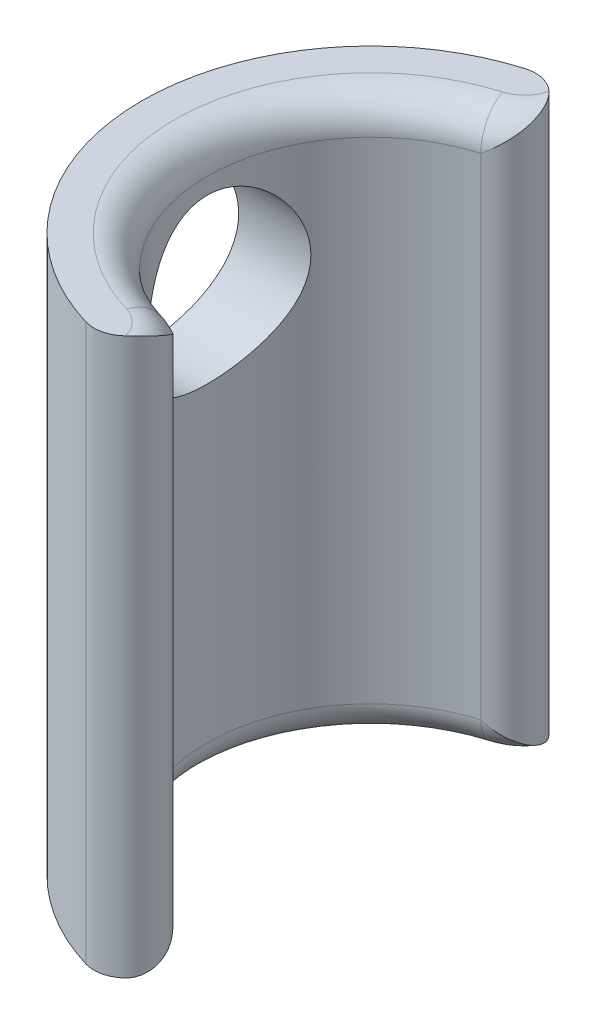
ISO-10303-21;
HEADER;
FILE_DESCRIPTION(('STEP AP214'),'2;1');
FILE_NAME('part.step','',(''),(''),'','','');
FILE_SCHEMA(('AUTOMOTIVE_DESIGN { 1 0 10303 214 1 1 1 1 }'));
ENDSEC;
DATA;
#1=APPLICATION_CONTEXT('core data for automotive mechanical design processes');
#2=APPLICATION_PROTOCOL_DEFINITION('international standard','automotive_design',2000,#1);
#3=PRODUCT_CONTEXT('',#1,'mechanical');
#4=PRODUCT('Part','Part','',(#3));
#5=PRODUCT_RELATED_PRODUCT_CATEGORY('part','',(#4));
#6=PRODUCT_DEFINITION_FORMATION('','',#4);
#7=PRODUCT_DEFINITION_CONTEXT('part definition',#1,'design');
#8=PRODUCT_DEFINITION('design','',#6,#7);
#9=PRODUCT_DEFINITION_SHAPE('','',#8);
#10=(LENGTH_UNIT() NAMED_UNIT(*) SI_UNIT(.MILLI.,.METRE.));
#11=(NAMED_UNIT(*) PLANE_ANGLE_UNIT() SI_UNIT($,.RADIAN.));
#12=(NAMED_UNIT(*) SI_UNIT($,.STERADIAN.) SOLID_ANGLE_UNIT());
#13=UNCERTAINTY_MEASURE_WITH_UNIT(LENGTH_MEASURE(1.E-05),#10,'distance_accuracy_value','');
#14=(GEOMETRIC_REPRESENTATION_CONTEXT(3) GLOBAL_UNCERTAINTY_ASSIGNED_CONTEXT((#13)) GLOBAL_UNIT_ASSIGNED_CONTEXT((#10,
#11,#12)) REPRESENTATION_CONTEXT('',''));
#15=CARTESIAN_POINT('',(0.,0.,0.));
#16=DIRECTION('',(0.,0.,1.));
#17=DIRECTION('',(1.,0.,0.));
#18=AXIS2_PLACEMENT_3D('',#15,#16,#17);
#19=CARTESIAN_POINT('',(0.,17.,0.));
#20=DIRECTION('',(0.,-1.,0.));
#21=DIRECTION('',(0.,0.,-1.));
#22=AXIS2_PLACEMENT_3D('',#19,#20,#21);
#23=CYLINDRICAL_SURFACE('',#22,5.);
#24=CARTESIAN_POINT('',(-4.33012701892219,13.,-2.5));
#25=CARTESIAN_POINT('',(-4.33013982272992,12.8697334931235,-2.49998948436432));
#26=CARTESIAN_POINT('',(-4.33609541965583,12.7392972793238,-2.48974954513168));
#27=CARTESIAN_POINT('',(-4.35905877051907,12.4824310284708,-2.44930840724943));
#28=CARTESIAN_POINT('',(-4.37608974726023,12.3560099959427,-2.41906526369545));
#29=CARTESIAN_POINT('',(-4.41873376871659,12.1113710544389,-2.3402497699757));
#30=CARTESIAN_POINT('',(-4.44430111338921,11.9931134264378,-2.29177485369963));
#31=CARTESIAN_POINT('',(-4.50106659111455,11.7664394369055,-2.17816884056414));
#32=CARTESIAN_POINT('',(-4.53226502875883,11.6580236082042,-2.11303684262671));
#33=CARTESIAN_POINT('',(-4.59992173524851,11.4442356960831,-1.96166634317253));
#34=CARTESIAN_POINT('',(-4.63660159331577,11.3398521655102,-1.87413008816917));
#35=CARTESIAN_POINT('',(-4.70929956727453,11.1464790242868,-1.68313452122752));
#36=CARTESIAN_POINT('',(-4.74531734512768,11.0574970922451,-1.57966731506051));
#37=CARTESIAN_POINT('',(-4.81553692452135,10.8915821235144,-1.35122390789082));
#38=CARTESIAN_POINT('',(-4.84945266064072,10.8158655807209,-1.22526797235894));
#39=CARTESIAN_POINT('',(-4.90876890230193,10.6871478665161,-0.960392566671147));
#40=CARTESIAN_POINT('',(-4.93417477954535,10.6341323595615,-0.821481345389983));
#41=CARTESIAN_POINT('',(-4.9720115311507,10.556238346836,-0.545112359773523));
#42=CARTESIAN_POINT('',(-4.98523700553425,10.5296261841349,-0.408254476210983));
#43=CARTESIAN_POINT('',(-5.00018959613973,10.4995847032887,-0.131426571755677));
#44=CARTESIAN_POINT('',(-5.00192366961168,10.4961413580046,0.00854151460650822));
#45=CARTESIAN_POINT('',(-4.99407454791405,10.5118666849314,0.274581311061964));
#46=CARTESIAN_POINT('',(-4.98546239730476,10.5290950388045,0.400802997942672));
#47=CARTESIAN_POINT('',(-4.95935613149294,10.5822021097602,0.64828442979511));
#48=CARTESIAN_POINT('',(-4.94186135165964,10.6180822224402,0.769543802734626));
#49=CARTESIAN_POINT('',(-4.89928958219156,10.7077064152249,1.00577347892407));
#50=CARTESIAN_POINT('',(-4.87411103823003,10.7616907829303,1.120633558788));
#51=CARTESIAN_POINT('',(-4.81844114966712,10.8856585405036,1.33994200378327));
#52=CARTESIAN_POINT('',(-4.78794790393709,10.9556476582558,1.4443866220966));
#53=CARTESIAN_POINT('',(-4.72110985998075,11.1172383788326,1.6504341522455));
#54=CARTESIAN_POINT('',(-4.68448439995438,11.210257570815,1.75083518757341));
#55=CARTESIAN_POINT('',(-4.61135851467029,11.4114743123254,1.93526092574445));
#56=CARTESIAN_POINT('',(-4.57485820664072,11.5196834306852,2.01927302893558));
#57=CARTESIAN_POINT('',(-4.50360390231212,11.7566204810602,2.17376333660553));
#58=CARTESIAN_POINT('',(-4.46910799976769,11.8862150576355,2.24304328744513));
#59=CARTESIAN_POINT('',(-4.4093862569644,12.1573441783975,2.35829778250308));
#60=CARTESIAN_POINT('',(-4.38415075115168,12.2988660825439,2.40429664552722));
#61=CARTESIAN_POINT('',(-4.34861589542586,12.578036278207,2.4679505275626));
#62=CARTESIAN_POINT('',(-4.33729139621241,12.7151027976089,2.48756280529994));
#63=CARTESIAN_POINT('',(-4.32794798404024,12.9910033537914,2.50379236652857));
#64=CARTESIAN_POINT('',(-4.32991967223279,13.1298360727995,2.50042589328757));
#65=CARTESIAN_POINT('',(-4.34585841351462,13.3891347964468,2.47259010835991));
#66=CARTESIAN_POINT('',(-4.35848968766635,13.5099486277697,2.45046954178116));
#67=CARTESIAN_POINT('',(-4.39235053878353,13.7459194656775,2.38924071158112));
#68=CARTESIAN_POINT('',(-4.41358290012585,13.8610746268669,2.35012694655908));
#69=CARTESIAN_POINT('',(-4.46340555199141,14.0885283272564,2.25411897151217));
#70=CARTESIAN_POINT('',(-4.49229108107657,14.2004475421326,2.19648515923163));
#71=CARTESIAN_POINT('',(-4.55390298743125,14.4136731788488,2.0657176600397));
#72=CARTESIAN_POINT('',(-4.58663133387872,14.5149741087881,1.99257601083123));
#73=CARTESIAN_POINT('',(-4.65719996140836,14.7174469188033,1.82209291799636));
#74=CARTESIAN_POINT('',(-4.69516457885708,14.8169928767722,1.72286318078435));
#75=CARTESIAN_POINT('',(-4.76835587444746,14.9985305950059,1.5085112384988));
#76=CARTESIAN_POINT('',(-4.80358162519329,15.0805164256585,1.39338368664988));
#77=CARTESIAN_POINT('',(-4.86853404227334,15.2264343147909,1.14633840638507));
#78=CARTESIAN_POINT('',(-4.89809104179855,15.2898327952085,1.01405774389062));
#79=CARTESIAN_POINT('',(-4.9470838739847,15.392844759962,0.738805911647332));
#80=CARTESIAN_POINT('',(-4.96652859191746,15.4324791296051,0.595844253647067));
#81=CARTESIAN_POINT('',(-4.99168770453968,15.4834214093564,0.317449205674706));
#82=CARTESIAN_POINT('',(-4.99849819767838,15.4969946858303,0.182528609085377));
#83=CARTESIAN_POINT('',(-5.00105325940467,15.5021081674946,-0.0878149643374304));
#84=CARTESIAN_POINT('',(-4.99680170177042,15.4936560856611,-0.223237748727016));
#85=CARTESIAN_POINT('',(-4.97834922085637,15.4564589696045,-0.481344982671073));
#86=CARTESIAN_POINT('',(-4.96482236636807,15.4290878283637,-0.604280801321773));
#87=CARTESIAN_POINT('',(-4.92980234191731,15.3566825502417,-0.843614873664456));
#88=CARTESIAN_POINT('',(-4.90830802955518,15.3116458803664,-0.960012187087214));
#89=CARTESIAN_POINT('',(-4.85814826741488,15.2031821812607,-1.18855854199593));
#90=CARTESIAN_POINT('',(-4.82921542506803,15.1390509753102,-1.30031295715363));
#91=CARTESIAN_POINT('',(-4.76720333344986,14.9951058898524,-1.51193650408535));
#92=CARTESIAN_POINT('',(-4.73412218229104,14.9152848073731,-1.61180014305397));
#93=CARTESIAN_POINT('',(-4.66321523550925,14.7330042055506,-1.8072854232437));
#94=CARTESIAN_POINT('',(-4.62524489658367,14.6290822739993,-1.90149582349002));
#95=CARTESIAN_POINT('',(-4.55157698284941,14.4063847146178,-2.07165660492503));
#96=CARTESIAN_POINT('',(-4.51588143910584,14.2875960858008,-2.1475908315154));
#97=CARTESIAN_POINT('',(-4.44998982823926,14.0333638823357,-2.28108393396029));
#98=CARTESIAN_POINT('',(-4.42000320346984,13.8975126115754,-2.3379862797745));
#99=CARTESIAN_POINT('',(-4.38370272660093,13.6867773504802,-2.40494911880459));
#100=CARTESIAN_POINT('',(-4.37305486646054,13.6154402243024,-2.42419582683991));
#101=CARTESIAN_POINT('',(-4.35507574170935,13.4709593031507,-2.45635087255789));
#102=CARTESIAN_POINT('',(-4.34774215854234,13.3978168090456,-2.46926364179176));
#103=CARTESIAN_POINT('',(-4.3382377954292,13.2704990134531,-2.48591166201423));
#104=CARTESIAN_POINT('',(-4.33520487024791,13.2165836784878,-2.49118864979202));
#105=CARTESIAN_POINT('',(-4.33114674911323,13.1084553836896,-2.49823512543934));
#106=CARTESIAN_POINT('',(-4.33012168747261,13.0542424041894,-2.50000437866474));
#107=CARTESIAN_POINT('',(-4.33012701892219,13.,-2.5));
#108=B_SPLINE_CURVE_WITH_KNOTS('',3,(#24,#25,#26,#27,#28,#29,#30,#31,#32,#33,#34,#35,#36,#37,
#38,#39,#40,#41,#42,#43,#44,#45,#46,#47,#48,#49,#50,#51,#52,#53,#54,#55,#56,#57,#58,#59,#60,#61,
#62,#63,#64,#65,#66,#67,#68,#69,#70,#71,#72,#73,#74,#75,#76,#77,#78,#79,#80,#81,#82,#83,#84,#85,
#86,#87,#88,#89,#90,#91,#92,#93,#94,#95,#96,#97,#98,#99,#100,#101,#102,#103,#104,#105,#106,
#107),.UNSPECIFIED.,.T.,.F.,(4,2,2,2,2,2,2,2,2,2,2,2,2,2,2,2,2,2,2,2,2,2,2,2,2,2,2,2,2,2,2,2,2,
2,2,2,2,2,2,2,2,4),(0.,0.39058030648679,0.781982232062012,1.17132148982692,1.56068181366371,
1.98215578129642,2.40383927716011,2.85394730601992,3.30377067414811,3.72158712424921,
4.13915059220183,4.52040243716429,4.90168281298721,5.2882383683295,5.67493248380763,
6.0981797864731,6.5217512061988,6.97222104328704,7.42221935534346,7.83655727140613,
8.25060232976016,8.61935458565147,8.98822631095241,9.37418241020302,9.76033715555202,
10.1951685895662,10.6301466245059,11.076604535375,11.5226694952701,11.927806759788,
12.3328021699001,12.7111106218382,13.0894733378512,13.4840187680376,13.8787457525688,
14.3127560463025,14.7471485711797,15.195268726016,15.4189244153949,15.6424233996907,
15.8050484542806,15.9676843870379),.UNSPECIFIED.);
#109=CARTESIAN_POINT('',(-4.33012701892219,13.,-2.5));
#110=VERTEX_POINT('',#109);
#111=EDGE_CURVE('E147',#110,#110,#108,.T.);
#112=ORIENTED_EDGE('',*,*,#111,.T.);
#113=EDGE_LOOP('',(#112));
#114=FACE_BOUND('',#113,.T.);
#115=DIRECTION('',(0.,-1.,0.));
#116=VECTOR('',#115,1.);
#117=CARTESIAN_POINT('',(-1.42857142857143,17.,-4.79157423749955));
#118=LINE('',#117,#116);
#119=CARTESIAN_POINT('',(-1.42857142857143,16.,-4.79157423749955));
#120=VERTEX_POINT('',#119);
#121=CARTESIAN_POINT('',(-1.42857142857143,1.,-4.79157423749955));
#122=VERTEX_POINT('',#121);
#123=EDGE_CURVE('E125',#120,#122,#118,.T.);
#124=ORIENTED_EDGE('',*,*,#123,.F.);
#125=CARTESIAN_POINT('',(0.,16.,0.));
#126=DIRECTION('',(0.,-1.,0.));
#127=DIRECTION('',(0.,0.,-1.));
#128=AXIS2_PLACEMENT_3D('',#125,#126,#127);
#129=CIRCLE('',#128,5.);
#130=CARTESIAN_POINT('',(-1.42857142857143,16.,4.79157423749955));
#131=VERTEX_POINT('',#130);
#132=EDGE_CURVE('E213',#120,#131,#129,.F.);
#133=ORIENTED_EDGE('',*,*,#132,.T.);
#134=DIRECTION('',(0.,-1.,0.));
#135=VECTOR('',#134,1.);
#136=CARTESIAN_POINT('',(-1.42857142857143,17.,4.79157423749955));
#137=LINE('',#136,#135);
#138=CARTESIAN_POINT('',(-1.42857142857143,1.,4.79157423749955));
#139=VERTEX_POINT('',#138);
#140=EDGE_CURVE('E117',#131,#139,#137,.T.);
#141=ORIENTED_EDGE('',*,*,#140,.T.);
#142=CARTESIAN_POINT('',(0.,1.,0.));
#143=DIRECTION('',(0.,-1.,0.));
#144=DIRECTION('',(0.,0.,-1.));
#145=AXIS2_PLACEMENT_3D('',#142,#143,#144);
#146=CIRCLE('',#145,5.);
#147=EDGE_CURVE('E206',#139,#122,#146,.T.);
#148=ORIENTED_EDGE('',*,*,#147,.T.);
#149=EDGE_LOOP('',(#124,#133,#141,#148));
#150=FACE_BOUND('',#149,.T.);
#151=ADVANCED_FACE('F37',(#114,#150),#23,.F.);
#152=CARTESIAN_POINT('',(0.,17.,0.));
#153=DIRECTION('',(0.,-1.,0.));
#154=DIRECTION('',(0.,0.,-1.));
#155=AXIS2_PLACEMENT_3D('',#152,#153,#154);
#156=CYLINDRICAL_SURFACE('',#155,7.);
#157=CARTESIAN_POINT('',(-7.,10.5,0.));
#158=CARTESIAN_POINT('',(-7.0000020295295,10.4999971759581,-0.135839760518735));
#159=CARTESIAN_POINT('',(-6.99601056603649,10.5111067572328,-0.271659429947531));
#160=CARTESIAN_POINT('',(-6.98048404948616,10.5550912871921,-0.539264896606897));
#161=CARTESIAN_POINT('',(-6.96894928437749,10.5879654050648,-0.671050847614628));
#162=CARTESIAN_POINT('',(-6.93958109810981,10.6741851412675,-0.926692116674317));
#163=CARTESIAN_POINT('',(-6.92175912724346,10.7274935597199,-1.05056137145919));
#164=CARTESIAN_POINT('',(-6.88161078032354,10.8528887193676,-1.28759585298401));
#165=CARTESIAN_POINT('',(-6.85928332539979,10.924979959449,-1.40075850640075));
#166=CARTESIAN_POINT('',(-6.81147377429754,11.0888431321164,-1.61758802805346));
#167=CARTESIAN_POINT('',(-6.78590827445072,11.1812187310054,-1.72078015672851));
#168=CARTESIAN_POINT('',(-6.73493522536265,11.3817463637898,-1.9105819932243));
#169=CARTESIAN_POINT('',(-6.70952771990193,11.4899025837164,-1.99718728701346));
#170=CARTESIAN_POINT('',(-6.6608007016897,11.7233977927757,-2.15423735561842));
#171=CARTESIAN_POINT('',(-6.63758107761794,11.8491947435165,-2.2240352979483));
#172=CARTESIAN_POINT('',(-6.59714352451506,12.1117036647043,-2.34127572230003));
#173=CARTESIAN_POINT('',(-6.57992345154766,12.2484117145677,-2.38872619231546));
#174=CARTESIAN_POINT('',(-6.55432038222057,12.5234228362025,-2.45809130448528));
#175=CARTESIAN_POINT('',(-6.54562733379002,12.6614693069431,-2.48090519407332));
#176=CARTESIAN_POINT('',(-6.53715061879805,12.9396836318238,-2.5031615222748));
#177=CARTESIAN_POINT('',(-6.53736369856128,13.0798506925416,-2.50261249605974));
#178=CARTESIAN_POINT('',(-6.54640588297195,13.3503556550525,-2.4788507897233));
#179=CARTESIAN_POINT('',(-6.55477363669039,13.4808183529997,-2.45685161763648));
#180=CARTESIAN_POINT('',(-6.57842082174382,13.7360615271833,-2.3928085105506));
#181=CARTESIAN_POINT('',(-6.59370119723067,13.8608412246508,-2.35076183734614));
#182=CARTESIAN_POINT('',(-6.62975170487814,14.1037737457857,-2.247095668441));
#183=CARTESIAN_POINT('',(-6.65061447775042,14.2217696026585,-2.18514195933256));
#184=CARTESIAN_POINT('',(-6.69544469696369,14.4460563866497,-2.04365272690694));
#185=CARTESIAN_POINT('',(-6.71941314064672,14.5523435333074,-1.96411154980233));
#186=CARTESIAN_POINT('',(-6.76952498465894,14.7569595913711,-1.78403149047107));
#187=CARTESIAN_POINT('',(-6.79571223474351,14.8544178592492,-1.68251331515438));
#188=CARTESIAN_POINT('',(-6.84605473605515,15.0311716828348,-1.46426184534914));
#189=CARTESIAN_POINT('',(-6.87020973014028,15.1104649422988,-1.3475266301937));
#190=CARTESIAN_POINT('',(-6.91416998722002,15.2494806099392,-1.10010034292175));
#191=CARTESIAN_POINT('',(-6.93391532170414,15.3089382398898,-0.969249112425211));
#192=CARTESIAN_POINT('',(-6.96639167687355,15.4047158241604,-0.698523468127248));
#193=CARTESIAN_POINT('',(-6.97912551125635,15.4410450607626,-0.558652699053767));
#194=CARTESIAN_POINT('',(-6.99566202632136,15.4879191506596,-0.281205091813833));
#195=CARTESIAN_POINT('',(-6.99987103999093,15.4996381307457,-0.143850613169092));
#196=CARTESIAN_POINT('',(-7.00012297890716,15.5003451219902,0.130909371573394));
#197=CARTESIAN_POINT('',(-6.99616751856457,15.4893376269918,0.268314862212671));
#198=CARTESIAN_POINT('',(-6.98080349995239,15.4458138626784,0.53436869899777));
#199=CARTESIAN_POINT('',(-6.96965417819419,15.4140452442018,0.6631558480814));
#200=CARTESIAN_POINT('',(-6.94128245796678,15.3308634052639,0.913499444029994));
#201=CARTESIAN_POINT('',(-6.9240592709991,15.2794476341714,1.03505494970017));
#202=CARTESIAN_POINT('',(-6.88465739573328,15.1568411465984,1.27131790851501));
#203=CARTESIAN_POINT('',(-6.86235262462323,15.0851335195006,1.38573546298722));
#204=CARTESIAN_POINT('',(-6.81528395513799,14.9245725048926,1.60127936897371));
#205=CARTESIAN_POINT('',(-6.79051921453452,14.8357132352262,1.70240114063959));
#206=CARTESIAN_POINT('',(-6.73966040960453,14.6378703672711,1.89402292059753));
#207=CARTESIAN_POINT('',(-6.71356479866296,14.5280752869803,1.9836868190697));
#208=CARTESIAN_POINT('',(-6.6642787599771,14.2944587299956,2.14345525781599));
#209=CARTESIAN_POINT('',(-6.64108847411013,14.1706365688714,2.21355884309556));
#210=CARTESIAN_POINT('',(-6.60040332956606,13.9119351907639,2.33208686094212));
#211=CARTESIAN_POINT('',(-6.58291456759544,13.7770443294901,2.3804881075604));
#212=CARTESIAN_POINT('',(-6.55601442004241,13.5002398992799,2.45361419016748));
#213=CARTESIAN_POINT('',(-6.54659865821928,13.3583301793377,2.4783518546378));
#214=CARTESIAN_POINT('',(-6.53745596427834,13.080479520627,2.50236255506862));
#215=CARTESIAN_POINT('',(-6.53719306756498,12.9446767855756,2.50304426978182));
#216=CARTESIAN_POINT('',(-6.54503319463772,12.6750023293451,2.48247035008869));
#217=CARTESIAN_POINT('',(-6.55313556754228,12.5411304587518,2.46121642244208));
#218=CARTESIAN_POINT('',(-6.57636700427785,12.2824994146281,2.39843007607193));
#219=CARTESIAN_POINT('',(-6.59131474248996,12.1575959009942,2.35741961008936));
#220=CARTESIAN_POINT('',(-6.62646329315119,11.9163573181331,2.25672644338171));
#221=CARTESIAN_POINT('',(-6.64666536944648,11.8000243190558,2.19703924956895));
#222=CARTESIAN_POINT('',(-6.69127230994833,11.5730742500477,2.05730313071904));
#223=CARTESIAN_POINT('',(-6.71583400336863,11.4630119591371,1.97640371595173));
#224=CARTESIAN_POINT('',(-6.76580411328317,11.2575724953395,1.79790863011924));
#225=CARTESIAN_POINT('',(-6.79121278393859,11.162199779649,1.70030791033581));
#226=CARTESIAN_POINT('',(-6.84145445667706,10.9842780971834,1.48566252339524));
#227=CARTESIAN_POINT('',(-6.86620367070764,10.9025469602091,1.36791750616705));
#228=CARTESIAN_POINT('',(-6.91104924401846,10.7600923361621,1.11951131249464));
#229=CARTESIAN_POINT('',(-6.93114595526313,10.6993672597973,0.988851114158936));
#230=CARTESIAN_POINT('',(-6.96446006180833,10.6008596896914,0.717646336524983));
#231=CARTESIAN_POINT('',(-6.97764821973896,10.5631745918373,0.577062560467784));
#232=CARTESIAN_POINT('',(-6.99541542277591,10.5127511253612,0.290976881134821));
#233=CARTESIAN_POINT('',(-6.99999782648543,10.5000030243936,0.145476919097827));
#234=CARTESIAN_POINT('',(-7.,10.5,0.));
#235=B_SPLINE_CURVE_WITH_KNOTS('',3,(#157,#158,#159,#160,#161,#162,#163,#164,#165,#166,#167,
#168,#169,#170,#171,#172,#173,#174,#175,#176,#177,#178,#179,#180,#181,#182,#183,#184,#185,#186,
#187,#188,#189,#190,#191,#192,#193,#194,#195,#196,#197,#198,#199,#200,#201,#202,#203,#204,#205,
#206,#207,#208,#209,#210,#211,#212,#213,#214,#215,#216,#217,#218,#219,#220,#221,#222,#223,#224,
#225,#226,#227,#228,#229,#230,#231,#232,#233,#234),.UNSPECIFIED.,.T.,.F.,(4,2,2,2,2,2,2,2,2,2,2,
2,2,2,2,2,2,2,2,2,2,2,2,2,2,2,2,2,2,2,2,2,2,2,2,2,2,2,4),(0.,0.406983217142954,
0.813950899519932,1.22018120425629,1.62650889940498,2.04714572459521,2.46789433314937,
2.90289606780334,3.3377421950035,3.75611562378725,4.17433620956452,4.57019246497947,
4.96610280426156,5.36904149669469,5.77210990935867,6.19956653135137,6.62707715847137,
7.06008524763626,7.49291944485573,7.90458529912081,8.31616976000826,8.71369326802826,
9.11126840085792,9.52005856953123,9.92898918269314,10.3593838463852,10.7897995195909,
11.2206739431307,11.6513146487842,12.0566930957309,12.4620400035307,12.8572208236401,
13.2524967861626,13.6670344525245,14.0816976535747,14.5159343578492,14.9501382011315,
15.3861650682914,15.8220217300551),.UNSPECIFIED.);
#236=CARTESIAN_POINT('',(-7.,10.5,0.));
#237=VERTEX_POINT('',#236);
#238=EDGE_CURVE('E11',#237,#237,#235,.T.);
#239=ORIENTED_EDGE('',*,*,#238,.T.);
#240=EDGE_LOOP('',(#239));
#241=FACE_BOUND('',#240,.T.);
#242=CARTESIAN_POINT('',(0.,0.,0.));
#243=DIRECTION('',(0.,1.,0.));
#244=DIRECTION('',(0.,0.,1.));
#245=AXIS2_PLACEMENT_3D('',#242,#243,#244);
#246=CIRCLE('',#245,7.);
#247=CARTESIAN_POINT('',(-2.,0.,-6.70820393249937));
#248=VERTEX_POINT('',#247);
#249=CARTESIAN_POINT('',(-2.,0.,6.70820393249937));
#250=VERTEX_POINT('',#249);
#251=EDGE_CURVE('E126',#248,#250,#246,.T.);
#252=ORIENTED_EDGE('',*,*,#251,.T.);
#253=DIRECTION('',(0.,-1.,0.));
#254=VECTOR('',#253,1.);
#255=CARTESIAN_POINT('',(-2.,17.,6.70820393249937));
#256=LINE('',#255,#254);
#257=CARTESIAN_POINT('',(-2.,17.,6.70820393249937));
#258=VERTEX_POINT('',#257);
#259=EDGE_CURVE('E51',#250,#258,#256,.F.);
#260=ORIENTED_EDGE('',*,*,#259,.T.);
#261=CARTESIAN_POINT('',(0.,17.,0.));
#262=DIRECTION('',(0.,1.,0.));
#263=DIRECTION('',(0.,0.,1.));
#264=AXIS2_PLACEMENT_3D('',#261,#262,#263);
#265=CIRCLE('',#264,7.);
#266=CARTESIAN_POINT('',(-2.,17.,-6.70820393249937));
#267=VERTEX_POINT('',#266);
#268=EDGE_CURVE('E110',#267,#258,#265,.T.);
#269=ORIENTED_EDGE('',*,*,#268,.F.);
#270=DIRECTION('',(0.,-1.,0.));
#271=VECTOR('',#270,1.);
#272=CARTESIAN_POINT('',(-2.,17.,-6.70820393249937));
#273=LINE('',#272,#271);
#274=EDGE_CURVE('E122',#267,#248,#273,.T.);
#275=ORIENTED_EDGE('',*,*,#274,.T.);
#276=EDGE_LOOP('',(#252,#260,#269,#275));
#277=FACE_BOUND('',#276,.T.);
#278=ADVANCED_FACE('F121',(#241,#277),#156,.T.);
#279=CARTESIAN_POINT('',(-2.,17.,6.70820393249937));
#280=DIRECTION('',(0.,-1.,0.));
#281=DIRECTION('',(0.,0.,-1.));
#282=AXIS2_PLACEMENT_3D('',#279,#280,#281);
#283=PLANE('',#282);
#284=ORIENTED_EDGE('',*,*,#268,.T.);
#285=CARTESIAN_POINT('',(-1.71428571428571,17.,5.74988908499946));
#286=DIRECTION('',(0.,-1.,0.));
#287=DIRECTION('',(0.,0.,-1.));
#288=AXIS2_PLACEMENT_3D('',#285,#286,#287);
#289=CIRCLE('',#288,1.);
#290=CARTESIAN_POINT('',(-1.02721785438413,17.,6.47648233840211));
#291=VERTEX_POINT('',#290);
#292=EDGE_CURVE('E217',#258,#291,#289,.F.);
#293=ORIENTED_EDGE('',*,*,#292,.T.);
#294=CARTESIAN_POINT('',(-2.,17.,6.70820393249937));
#295=DIRECTION('',(0.,-1.,0.));
#296=DIRECTION('',(0.,0.,-1.));
#297=AXIS2_PLACEMENT_3D('',#294,#295,#296);
#298=CIRCLE('',#297,1.);
#299=CARTESIAN_POINT('',(-1.71428571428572,17.,5.74988908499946));
#300=VERTEX_POINT('',#299);
#301=EDGE_CURVE('E219',#291,#300,#298,.F.);
#302=ORIENTED_EDGE('',*,*,#301,.T.);
#303=CARTESIAN_POINT('',(0.,17.,0.));
#304=DIRECTION('',(0.,-1.,0.));
#305=DIRECTION('',(0.,0.,-1.));
#306=AXIS2_PLACEMENT_3D('',#303,#304,#305);
#307=CIRCLE('',#306,6.);
#308=CARTESIAN_POINT('',(-1.71428571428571,17.,-5.74988908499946));
#309=VERTEX_POINT('',#308);
#310=EDGE_CURVE('E221',#300,#309,#307,.T.);
#311=ORIENTED_EDGE('',*,*,#310,.T.);
#312=CARTESIAN_POINT('',(-2.,17.,-6.70820393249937));
#313=DIRECTION('',(0.,-1.,0.));
#314=DIRECTION('',(0.,0.,-1.));
#315=AXIS2_PLACEMENT_3D('',#312,#313,#314);
#316=CIRCLE('',#315,1.);
#317=CARTESIAN_POINT('',(-1.02721785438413,17.,-6.47648233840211));
#318=VERTEX_POINT('',#317);
#319=EDGE_CURVE('E113',#309,#318,#316,.F.);
#320=ORIENTED_EDGE('',*,*,#319,.T.);
#321=CARTESIAN_POINT('',(-1.71428571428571,17.,-5.74988908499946));
#322=DIRECTION('',(0.,-1.,0.));
#323=DIRECTION('',(0.,0.,-1.));
#324=AXIS2_PLACEMENT_3D('',#321,#322,#323);
#325=CIRCLE('',#324,1.);
#326=EDGE_CURVE('E107',#318,#267,#325,.F.);
#327=ORIENTED_EDGE('',*,*,#326,.T.);
#328=EDGE_LOOP('',(#284,#293,#302,#311,#320,#327));
#329=FACE_BOUND('',#328,.T.);
#330=ADVANCED_FACE('F109',(#329),#283,.F.);
#331=CARTESIAN_POINT('',(-2.,0.,6.70820393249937));
#332=DIRECTION('',(0.,-1.,0.));
#333=DIRECTION('',(0.,0.,-1.));
#334=AXIS2_PLACEMENT_3D('',#331,#332,#333);
#335=PLANE('',#334);
#336=CARTESIAN_POINT('',(-2.,0.,6.70820393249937));
#337=DIRECTION('',(0.,-1.,0.));
#338=DIRECTION('',(0.,0.,-1.));
#339=AXIS2_PLACEMENT_3D('',#336,#337,#338);
#340=CIRCLE('',#339,1.);
#341=CARTESIAN_POINT('',(-1.71428571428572,0.,5.74988908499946));
#342=VERTEX_POINT('',#341);
#343=CARTESIAN_POINT('',(-1.02721785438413,0.,6.47648233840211));
#344=VERTEX_POINT('',#343);
#345=EDGE_CURVE('E58',#342,#344,#340,.T.);
#346=ORIENTED_EDGE('',*,*,#345,.T.);
#347=CARTESIAN_POINT('',(-1.71428571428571,0.,5.74988908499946));
#348=DIRECTION('',(0.,-1.,0.));
#349=DIRECTION('',(0.,0.,-1.));
#350=AXIS2_PLACEMENT_3D('',#347,#348,#349);
#351=CIRCLE('',#350,1.);
#352=EDGE_CURVE('E132',#344,#250,#351,.T.);
#353=ORIENTED_EDGE('',*,*,#352,.T.);
#354=ORIENTED_EDGE('',*,*,#251,.F.);
#355=CARTESIAN_POINT('',(-1.71428571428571,0.,-5.74988908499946));
#356=DIRECTION('',(0.,-1.,0.));
#357=DIRECTION('',(0.,0.,-1.));
#358=AXIS2_PLACEMENT_3D('',#355,#356,#357);
#359=CIRCLE('',#358,1.);
#360=CARTESIAN_POINT('',(-1.02721785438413,0.,-6.47648233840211));
#361=VERTEX_POINT('',#360);
#362=EDGE_CURVE('E131',#248,#361,#359,.T.);
#363=ORIENTED_EDGE('',*,*,#362,.T.);
#364=CARTESIAN_POINT('',(-2.,0.,-6.70820393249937));
#365=DIRECTION('',(0.,-1.,0.));
#366=DIRECTION('',(0.,0.,-1.));
#367=AXIS2_PLACEMENT_3D('',#364,#365,#366);
#368=CIRCLE('',#367,1.);
#369=CARTESIAN_POINT('',(-1.71428571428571,0.,-5.74988908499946));
#370=VERTEX_POINT('',#369);
#371=EDGE_CURVE('E208',#361,#370,#368,.T.);
#372=ORIENTED_EDGE('',*,*,#371,.T.);
#373=CARTESIAN_POINT('',(0.,0.,0.));
#374=DIRECTION('',(0.,-1.,0.));
#375=DIRECTION('',(0.,0.,-1.));
#376=AXIS2_PLACEMENT_3D('',#373,#374,#375);
#377=CIRCLE('',#376,6.);
#378=EDGE_CURVE('E63',#370,#342,#377,.F.);
#379=ORIENTED_EDGE('',*,*,#378,.T.);
#380=EDGE_LOOP('',(#346,#353,#354,#363,#372,#379));
#381=FACE_BOUND('',#380,.T.);
#382=ADVANCED_FACE('F239',(#381),#335,.T.);
#383=CARTESIAN_POINT('',(-2.,1.,6.70820393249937));
#384=DIRECTION('',(0.,-1.,0.));
#385=DIRECTION('',(0.,0.,-1.));
#386=AXIS2_PLACEMENT_3D('',#383,#384,#385);
#387=DEGENERATE_TOROIDAL_SURFACE('',#386,1.,1.,.T.);
#388=CARTESIAN_POINT('',(-1.71428571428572,1.,5.74988908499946));
#389=DIRECTION('',(-0.95831484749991,0.,-0.285714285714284));
#390=DIRECTION('',(-0.285714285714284,0.,0.95831484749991));
#391=AXIS2_PLACEMENT_3D('',#388,#389,#390);
#392=CIRCLE('',#391,1.);
#393=EDGE_CURVE('E184',#139,#342,#392,.T.);
#394=ORIENTED_EDGE('',*,*,#393,.F.);
#395=CARTESIAN_POINT('',(-1.02721785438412,0.,6.47648233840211));
#396=CARTESIAN_POINT('',(-0.996357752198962,4.79517161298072E-07,6.44734826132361));
#397=CARTESIAN_POINT('',(-0.967447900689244,0.00202482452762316,6.41624833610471));
#398=CARTESIAN_POINT('',(-0.914044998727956,0.00964373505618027,6.35102664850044));
#399=CARTESIAN_POINT('',(-0.889537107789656,0.0152260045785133,6.3169156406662));
#400=CARTESIAN_POINT('',(-0.842817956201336,0.0302683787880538,6.24251903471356));
#401=CARTESIAN_POINT('',(-0.82114964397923,0.0400853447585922,6.20196591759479));
#402=CARTESIAN_POINT('',(-0.783795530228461,0.0629540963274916,6.11902312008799));
#403=CARTESIAN_POINT('',(-0.768117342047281,0.076009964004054,6.07663117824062));
#404=CARTESIAN_POINT('',(-0.741280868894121,0.10651633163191,5.98599787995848));
#405=CARTESIAN_POINT('',(-0.730862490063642,0.124301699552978,5.93765069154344));
#406=CARTESIAN_POINT('',(-0.717254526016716,0.162635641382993,5.84105456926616));
#407=CARTESIAN_POINT('',(-0.71406731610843,0.18318512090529,5.79280567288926));
#408=CARTESIAN_POINT('',(-0.714558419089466,0.22949137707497,5.69088352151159));
#409=CARTESIAN_POINT('',(-0.719228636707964,0.255576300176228,5.6373642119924));
#410=CARTESIAN_POINT('',(-0.7366754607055,0.310049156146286,5.53289369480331));
#411=CARTESIAN_POINT('',(-0.749455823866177,0.338438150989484,5.48194368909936));
#412=CARTESIAN_POINT('',(-0.784546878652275,0.400948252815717,5.37700940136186));
#413=CARTESIAN_POINT('',(-0.807902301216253,0.435328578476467,5.32352844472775));
#414=CARTESIAN_POINT('',(-0.862857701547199,0.505850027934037,5.2222586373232));
#415=CARTESIAN_POINT('',(-0.894462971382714,0.541992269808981,5.17447346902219));
#416=CARTESIAN_POINT('',(-0.968760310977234,0.619789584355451,5.08042422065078));
#417=CARTESIAN_POINT('',(-1.01230906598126,0.661600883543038,5.03496598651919));
#418=CARTESIAN_POINT('',(-1.10649349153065,0.746254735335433,4.95335411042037));
#419=CARTESIAN_POINT('',(-1.1571262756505,0.789096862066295,4.91719669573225));
#420=CARTESIAN_POINT('',(-1.24380743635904,0.859174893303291,4.86663007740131));
#421=CARTESIAN_POINT('',(-1.27823099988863,0.886257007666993,4.84914393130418));
#422=CARTESIAN_POINT('',(-1.34875702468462,0.940509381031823,4.81829582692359));
#423=CARTESIAN_POINT('',(-1.38485704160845,0.967679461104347,4.80492806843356));
#424=CARTESIAN_POINT('',(-1.42390833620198,0.996557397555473,4.79297376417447));
#425=CARTESIAN_POINT('',(-1.42623866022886,0.99827873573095,4.79226971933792));
#426=CARTESIAN_POINT('',(-1.42857142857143,1.,4.79157423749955));
#427=B_SPLINE_CURVE_WITH_KNOTS('',3,(#395,#396,#397,#398,#399,#400,#401,#402,#403,#404,#405,
#406,#407,#408,#409,#410,#411,#412,#413,#414,#415,#416,#417,#418,#419,#420,#421,#422,#423,#424,
#425,#426),.UNSPECIFIED.,.F.,.F.,(4,2,2,2,2,2,2,2,2,2,2,2,2,2,2,4),(0.,0.12708251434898,
0.253728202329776,0.394202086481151,0.53485392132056,0.691901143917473,0.848999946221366,
1.0274488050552,1.20598038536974,1.40835197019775,1.61085369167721,1.83662630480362,
2.06230719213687,2.20361182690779,2.34471653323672,2.35366084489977),.UNSPECIFIED.);
#428=EDGE_CURVE('E192',#344,#139,#427,.T.);
#429=ORIENTED_EDGE('',*,*,#428,.F.);
#430=ORIENTED_EDGE('',*,*,#345,.F.);
#431=EDGE_LOOP('',(#394,#429,#430));
#432=FACE_BOUND('',#431,.T.);
#433=ADVANCED_FACE('F39',(#432),#387,.T.);
#434=CARTESIAN_POINT('',(-1.71428571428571,17.,5.74988908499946));
#435=DIRECTION('',(0.,-1.,0.));
#436=DIRECTION('',(0.,0.,-1.));
#437=AXIS2_PLACEMENT_3D('',#434,#435,#436);
#438=CYLINDRICAL_SURFACE('',#437,1.);
#439=ORIENTED_EDGE('',*,*,#428,.T.);
#440=ORIENTED_EDGE('',*,*,#140,.F.);
#441=CARTESIAN_POINT('',(-1.02721785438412,17.,6.47648233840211));
#442=CARTESIAN_POINT('',(-0.996357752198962,16.9999995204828,6.44734826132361));
#443=CARTESIAN_POINT('',(-0.967447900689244,16.9979751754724,6.41624833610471));
#444=CARTESIAN_POINT('',(-0.914044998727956,16.9903562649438,6.35102664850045));
#445=CARTESIAN_POINT('',(-0.889537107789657,16.9847739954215,6.3169156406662));
#446=CARTESIAN_POINT('',(-0.842817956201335,16.9697316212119,6.24251903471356));
#447=CARTESIAN_POINT('',(-0.821149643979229,16.9599146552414,6.20196591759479));
#448=CARTESIAN_POINT('',(-0.78379553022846,16.9370459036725,6.11902312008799));
#449=CARTESIAN_POINT('',(-0.76811734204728,16.9239900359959,6.07663117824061));
#450=CARTESIAN_POINT('',(-0.741280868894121,16.8934836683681,5.98599787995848));
#451=CARTESIAN_POINT('',(-0.730862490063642,16.875698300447,5.93765069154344));
#452=CARTESIAN_POINT('',(-0.717254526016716,16.837364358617,5.84105456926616));
#453=CARTESIAN_POINT('',(-0.71406731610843,16.8168148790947,5.79280567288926));
#454=CARTESIAN_POINT('',(-0.714558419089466,16.770508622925,5.69088352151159));
#455=CARTESIAN_POINT('',(-0.719228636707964,16.7444236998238,5.6373642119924));
#456=CARTESIAN_POINT('',(-0.7366754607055,16.6899508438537,5.53289369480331));
#457=CARTESIAN_POINT('',(-0.749455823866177,16.6615618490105,5.48194368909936));
#458=CARTESIAN_POINT('',(-0.784546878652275,16.5990517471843,5.37700940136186));
#459=CARTESIAN_POINT('',(-0.807902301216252,16.5646714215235,5.32352844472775));
#460=CARTESIAN_POINT('',(-0.862857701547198,16.494149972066,5.2222586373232));
#461=CARTESIAN_POINT('',(-0.894462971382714,16.458007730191,5.17447346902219));
#462=CARTESIAN_POINT('',(-0.968760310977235,16.3802104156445,5.08042422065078));
#463=CARTESIAN_POINT('',(-1.01230906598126,16.338399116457,5.03496598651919));
#464=CARTESIAN_POINT('',(-1.10649349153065,16.2537452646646,4.95335411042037));
#465=CARTESIAN_POINT('',(-1.1571262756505,16.2109031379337,4.91719669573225));
#466=CARTESIAN_POINT('',(-1.24380743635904,16.1408251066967,4.86663007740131));
#467=CARTESIAN_POINT('',(-1.27823099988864,16.113742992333,4.84914393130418));
#468=CARTESIAN_POINT('',(-1.34875702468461,16.0594906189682,4.81829582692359));
#469=CARTESIAN_POINT('',(-1.38485704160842,16.0323205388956,4.80492806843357));
#470=CARTESIAN_POINT('',(-1.42390833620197,16.0034426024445,4.79297376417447));
#471=CARTESIAN_POINT('',(-1.42623866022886,16.0017212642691,4.79226971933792));
#472=CARTESIAN_POINT('',(-1.42857142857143,16.,4.79157423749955));
#473=B_SPLINE_CURVE_WITH_KNOTS('',3,(#441,#442,#443,#444,#445,#446,#447,#448,#449,#450,#451,
#452,#453,#454,#455,#456,#457,#458,#459,#460,#461,#462,#463,#464,#465,#466,#467,#468,#469,#470,
#471,#472),.UNSPECIFIED.,.F.,.F.,(4,2,2,2,2,2,2,2,2,2,2,2,2,2,2,4),(0.,0.127082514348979,
0.253728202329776,0.394202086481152,0.53485392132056,0.691901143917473,0.848999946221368,
1.0274488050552,1.20598038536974,1.40835197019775,1.61085369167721,1.83662630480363,
2.06230719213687,2.20361182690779,2.34471653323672,2.35366084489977),.UNSPECIFIED.);
#474=EDGE_CURVE('E176',#291,#131,#473,.T.);
#475=ORIENTED_EDGE('',*,*,#474,.F.);
#476=ORIENTED_EDGE('',*,*,#292,.F.);
#477=ORIENTED_EDGE('',*,*,#259,.F.);
#478=ORIENTED_EDGE('',*,*,#352,.F.);
#479=EDGE_LOOP('',(#439,#440,#475,#476,#477,#478));
#480=FACE_BOUND('',#479,.T.);
#481=ADVANCED_FACE('F186',(#480),#438,.T.);
#482=CARTESIAN_POINT('',(0.,1.,0.));
#483=DIRECTION('',(0.,-1.,0.));
#484=DIRECTION('',(0.,0.,-1.));
#485=AXIS2_PLACEMENT_3D('',#482,#483,#484);
#486=TOROIDAL_SURFACE('',#485,6.,1.);
#487=ORIENTED_EDGE('',*,*,#393,.T.);
#488=ORIENTED_EDGE('',*,*,#378,.F.);
#489=CARTESIAN_POINT('',(-1.71428571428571,1.,-5.74988908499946));
#490=DIRECTION('',(0.95831484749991,0.,-0.285714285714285));
#491=DIRECTION('',(-0.285714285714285,0.,-0.95831484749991));
#492=AXIS2_PLACEMENT_3D('',#489,#490,#491);
#493=CIRCLE('',#492,1.);
#494=EDGE_CURVE('E173',#122,#370,#493,.T.);
#495=ORIENTED_EDGE('',*,*,#494,.F.);
#496=ORIENTED_EDGE('',*,*,#147,.F.);
#497=EDGE_LOOP('',(#487,#488,#495,#496));
#498=FACE_BOUND('',#497,.T.);
#499=ADVANCED_FACE('F189',(#498),#486,.T.);
#500=CARTESIAN_POINT('',(-2.,16.,6.70820393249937));
#501=DIRECTION('',(0.,-1.,0.));
#502=DIRECTION('',(0.,0.,-1.));
#503=AXIS2_PLACEMENT_3D('',#500,#501,#502);
#504=DEGENERATE_TOROIDAL_SURFACE('',#503,1.,1.,.T.);
#505=ORIENTED_EDGE('',*,*,#301,.F.);
#506=ORIENTED_EDGE('',*,*,#474,.T.);
#507=CARTESIAN_POINT('',(-1.71428571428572,16.,5.74988908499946));
#508=DIRECTION('',(-0.95831484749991,0.,-0.285714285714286));
#509=DIRECTION('',(-0.285714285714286,0.,0.95831484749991));
#510=AXIS2_PLACEMENT_3D('',#507,#508,#509);
#511=CIRCLE('',#510,1.);
#512=EDGE_CURVE('E171',#300,#131,#511,.T.);
#513=ORIENTED_EDGE('',*,*,#512,.F.);
#514=EDGE_LOOP('',(#505,#506,#513));
#515=FACE_BOUND('',#514,.T.);
#516=ADVANCED_FACE('F162',(#515),#504,.T.);
#517=CARTESIAN_POINT('',(-2.,1.,-6.70820393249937));
#518=DIRECTION('',(0.,-1.,0.));
#519=DIRECTION('',(0.,0.,-1.));
#520=AXIS2_PLACEMENT_3D('',#517,#518,#519);
#521=DEGENERATE_TOROIDAL_SURFACE('',#520,1.,1.,.T.);
#522=ORIENTED_EDGE('',*,*,#494,.T.);
#523=ORIENTED_EDGE('',*,*,#371,.F.);
#524=CARTESIAN_POINT('',(-1.02721785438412,0.,-6.47648233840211));
#525=CARTESIAN_POINT('',(-0.996357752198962,4.7951716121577E-07,-6.44734826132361));
#526=CARTESIAN_POINT('',(-0.967447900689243,0.00202482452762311,-6.41624833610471));
#527=CARTESIAN_POINT('',(-0.914044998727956,0.00964373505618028,-6.35102664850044));
#528=CARTESIAN_POINT('',(-0.889537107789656,0.0152260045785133,-6.3169156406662));
#529=CARTESIAN_POINT('',(-0.842817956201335,0.0302683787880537,-6.24251903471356));
#530=CARTESIAN_POINT('',(-0.82114964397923,0.040085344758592,-6.20196591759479));
#531=CARTESIAN_POINT('',(-0.783795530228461,0.0629540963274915,-6.11902312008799));
#532=CARTESIAN_POINT('',(-0.76811734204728,0.076009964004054,-6.07663117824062));
#533=CARTESIAN_POINT('',(-0.741280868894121,0.106516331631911,-5.98599787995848));
#534=CARTESIAN_POINT('',(-0.730862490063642,0.124301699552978,-5.93765069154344));
#535=CARTESIAN_POINT('',(-0.717254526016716,0.162635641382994,-5.84105456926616));
#536=CARTESIAN_POINT('',(-0.71406731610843,0.18318512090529,-5.79280567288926));
#537=CARTESIAN_POINT('',(-0.714558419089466,0.229491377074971,-5.69088352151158));
#538=CARTESIAN_POINT('',(-0.719228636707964,0.255576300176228,-5.6373642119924));
#539=CARTESIAN_POINT('',(-0.7366754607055,0.310049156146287,-5.53289369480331));
#540=CARTESIAN_POINT('',(-0.749455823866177,0.338438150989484,-5.48194368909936));
#541=CARTESIAN_POINT('',(-0.784546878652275,0.400948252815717,-5.37700940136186));
#542=CARTESIAN_POINT('',(-0.807902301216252,0.435328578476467,-5.32352844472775));
#543=CARTESIAN_POINT('',(-0.862857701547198,0.505850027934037,-5.2222586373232));
#544=CARTESIAN_POINT('',(-0.894462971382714,0.541992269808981,-5.17447346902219));
#545=CARTESIAN_POINT('',(-0.968760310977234,0.619789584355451,-5.08042422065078));
#546=CARTESIAN_POINT('',(-1.01230906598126,0.661600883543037,-5.03496598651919));
#547=CARTESIAN_POINT('',(-1.10649349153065,0.746254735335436,-4.95335411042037));
#548=CARTESIAN_POINT('',(-1.15712627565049,0.789096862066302,-4.91719669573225));
#549=CARTESIAN_POINT('',(-1.24380743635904,0.859174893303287,-4.86663007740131));
#550=CARTESIAN_POINT('',(-1.27823099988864,0.88625700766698,-4.84914393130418));
#551=CARTESIAN_POINT('',(-1.34875702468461,0.94050938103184,-4.8182958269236));
#552=CARTESIAN_POINT('',(-1.38485704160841,0.967679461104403,-4.80492806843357));
#553=CARTESIAN_POINT('',(-1.42390833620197,0.99655739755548,-4.79297376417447));
#554=CARTESIAN_POINT('',(-1.42623866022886,0.998278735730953,-4.79226971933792));
#555=CARTESIAN_POINT('',(-1.42857142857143,1.,-4.79157423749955));
#556=B_SPLINE_CURVE_WITH_KNOTS('',3,(#524,#525,#526,#527,#528,#529,#530,#531,#532,#533,#534,
#535,#536,#537,#538,#539,#540,#541,#542,#543,#544,#545,#546,#547,#548,#549,#550,#551,#552,#553,
#554,#555),.UNSPECIFIED.,.F.,.F.,(4,2,2,2,2,2,2,2,2,2,2,2,2,2,2,4),(0.,0.12708251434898,
0.253728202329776,0.394202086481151,0.53485392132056,0.691901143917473,0.848999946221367,
1.0274488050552,1.20598038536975,1.40835197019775,1.61085369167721,1.83662630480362,
2.06230719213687,2.20361182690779,2.34471653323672,2.35366084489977),.UNSPECIFIED.);
#557=EDGE_CURVE('E165',#122,#361,#556,.F.);
#558=ORIENTED_EDGE('',*,*,#557,.F.);
#559=EDGE_LOOP('',(#522,#523,#558));
#560=FACE_BOUND('',#559,.T.);
#561=ADVANCED_FACE('F157',(#560),#521,.T.);
#562=CARTESIAN_POINT('',(0.,16.,0.));
#563=DIRECTION('',(0.,-1.,0.));
#564=DIRECTION('',(0.,0.,-1.));
#565=AXIS2_PLACEMENT_3D('',#562,#563,#564);
#566=TOROIDAL_SURFACE('',#565,6.,1.);
#567=ORIENTED_EDGE('',*,*,#512,.T.);
#568=ORIENTED_EDGE('',*,*,#132,.F.);
#569=CARTESIAN_POINT('',(-1.71428571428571,16.,-5.74988908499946));
#570=DIRECTION('',(0.95831484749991,0.,-0.285714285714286));
#571=DIRECTION('',(-0.285714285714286,0.,-0.95831484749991));
#572=AXIS2_PLACEMENT_3D('',#569,#570,#571);
#573=CIRCLE('',#572,1.);
#574=EDGE_CURVE('E146',#309,#120,#573,.T.);
#575=ORIENTED_EDGE('',*,*,#574,.F.);
#576=ORIENTED_EDGE('',*,*,#310,.F.);
#577=EDGE_LOOP('',(#567,#568,#575,#576));
#578=FACE_BOUND('',#577,.T.);
#579=ADVANCED_FACE('F161',(#578),#566,.T.);
#580=CARTESIAN_POINT('',(-1.71428571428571,17.,-5.74988908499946));
#581=DIRECTION('',(0.,-1.,0.));
#582=DIRECTION('',(0.,0.,-1.));
#583=AXIS2_PLACEMENT_3D('',#580,#581,#582);
#584=CYLINDRICAL_SURFACE('',#583,1.);
#585=ORIENTED_EDGE('',*,*,#274,.F.);
#586=ORIENTED_EDGE('',*,*,#326,.F.);
#587=CARTESIAN_POINT('',(-1.02721785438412,17.,-6.47648233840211));
#588=CARTESIAN_POINT('',(-0.996357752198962,16.9999995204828,-6.44734826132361));
#589=CARTESIAN_POINT('',(-0.967447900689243,16.9979751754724,-6.41624833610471));
#590=CARTESIAN_POINT('',(-0.914044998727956,16.9903562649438,-6.35102664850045));
#591=CARTESIAN_POINT('',(-0.889537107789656,16.9847739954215,-6.3169156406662));
#592=CARTESIAN_POINT('',(-0.842817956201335,16.9697316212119,-6.24251903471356));
#593=CARTESIAN_POINT('',(-0.821149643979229,16.9599146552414,-6.20196591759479));
#594=CARTESIAN_POINT('',(-0.78379553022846,16.9370459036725,-6.11902312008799));
#595=CARTESIAN_POINT('',(-0.76811734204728,16.9239900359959,-6.07663117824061));
#596=CARTESIAN_POINT('',(-0.741280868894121,16.8934836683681,-5.98599787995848));
#597=CARTESIAN_POINT('',(-0.730862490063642,16.875698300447,-5.93765069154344));
#598=CARTESIAN_POINT('',(-0.717254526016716,16.837364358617,-5.84105456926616));
#599=CARTESIAN_POINT('',(-0.71406731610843,16.8168148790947,-5.79280567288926));
#600=CARTESIAN_POINT('',(-0.714558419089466,16.770508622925,-5.69088352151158));
#601=CARTESIAN_POINT('',(-0.719228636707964,16.7444236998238,-5.63736421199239));
#602=CARTESIAN_POINT('',(-0.736675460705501,16.6899508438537,-5.5328936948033));
#603=CARTESIAN_POINT('',(-0.749455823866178,16.6615618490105,-5.48194368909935));
#604=CARTESIAN_POINT('',(-0.784546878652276,16.5990517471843,-5.37700940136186));
#605=CARTESIAN_POINT('',(-0.807902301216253,16.5646714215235,-5.32352844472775));
#606=CARTESIAN_POINT('',(-0.862857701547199,16.494149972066,-5.2222586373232));
#607=CARTESIAN_POINT('',(-0.894462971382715,16.458007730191,-5.17447346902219));
#608=CARTESIAN_POINT('',(-0.968760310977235,16.3802104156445,-5.08042422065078));
#609=CARTESIAN_POINT('',(-1.01230906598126,16.338399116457,-5.03496598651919));
#610=CARTESIAN_POINT('',(-1.10649349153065,16.2537452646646,-4.95335411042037));
#611=CARTESIAN_POINT('',(-1.1571262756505,16.2109031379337,-4.91719669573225));
#612=CARTESIAN_POINT('',(-1.24380743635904,16.1408251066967,-4.86663007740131));
#613=CARTESIAN_POINT('',(-1.27823099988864,16.113742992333,-4.84914393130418));
#614=CARTESIAN_POINT('',(-1.34875702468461,16.0594906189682,-4.81829582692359));
#615=CARTESIAN_POINT('',(-1.38485704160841,16.0323205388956,-4.80492806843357));
#616=CARTESIAN_POINT('',(-1.42390833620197,16.0034426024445,-4.79297376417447));
#617=CARTESIAN_POINT('',(-1.42623866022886,16.001721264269,-4.79226971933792));
#618=CARTESIAN_POINT('',(-1.42857142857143,16.,-4.79157423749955));
#619=B_SPLINE_CURVE_WITH_KNOTS('',3,(#587,#588,#589,#590,#591,#592,#593,#594,#595,#596,#597,
#598,#599,#600,#601,#602,#603,#604,#605,#606,#607,#608,#609,#610,#611,#612,#613,#614,#615,#616,
#617,#618),.UNSPECIFIED.,.F.,.F.,(4,2,2,2,2,2,2,2,2,2,2,2,2,2,2,4),(0.,0.12708251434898,
0.253728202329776,0.394202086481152,0.53485392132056,0.691901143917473,0.848999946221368,
1.0274488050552,1.20598038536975,1.40835197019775,1.61085369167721,1.83662630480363,
2.06230719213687,2.20361182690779,2.34471653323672,2.35366084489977),.UNSPECIFIED.);
#620=EDGE_CURVE('E138',#120,#318,#619,.F.);
#621=ORIENTED_EDGE('',*,*,#620,.F.);
#622=ORIENTED_EDGE('',*,*,#123,.T.);
#623=ORIENTED_EDGE('',*,*,#557,.T.);
#624=ORIENTED_EDGE('',*,*,#362,.F.);
#625=EDGE_LOOP('',(#585,#586,#621,#622,#623,#624));
#626=FACE_BOUND('',#625,.T.);
#627=ADVANCED_FACE('F129',(#626),#584,.T.);
#628=CARTESIAN_POINT('',(-2.,16.,-6.70820393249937));
#629=DIRECTION('',(0.,-1.,0.));
#630=DIRECTION('',(0.,0.,-1.));
#631=AXIS2_PLACEMENT_3D('',#628,#629,#630);
#632=DEGENERATE_TOROIDAL_SURFACE('',#631,1.,1.,.T.);
#633=ORIENTED_EDGE('',*,*,#319,.F.);
#634=ORIENTED_EDGE('',*,*,#574,.T.);
#635=ORIENTED_EDGE('',*,*,#620,.T.);
#636=EDGE_LOOP('',(#633,#634,#635));
#637=FACE_BOUND('',#636,.T.);
#638=ADVANCED_FACE('F151',(#637),#632,.T.);
#639=CARTESIAN_POINT('',(-7.,13.,0.));
#640=DIRECTION('',(1.,0.,0.));
#641=DIRECTION('',(0.,0.,-1.));
#642=AXIS2_PLACEMENT_3D('',#639,#640,#641);
#643=CYLINDRICAL_SURFACE('',#642,2.5);
#644=ORIENTED_EDGE('',*,*,#238,.F.);
#645=EDGE_LOOP('',(#644));
#646=FACE_BOUND('',#645,.T.);
#647=ORIENTED_EDGE('',*,*,#111,.F.);
#648=EDGE_LOOP('',(#647));
#649=FACE_BOUND('',#648,.T.);
#650=ADVANCED_FACE('F155',(#646,#649),#643,.F.);
#651=CLOSED_SHELL('',(#151,#278,#330,#382,#433,#481,#499,#516,#561,#579,#627,#638,#650));
#652=MANIFOLD_SOLID_BREP('B2',#651);
#653=ADVANCED_BREP_SHAPE_REPRESENTATION('',(#18,#652),#14);
#654=SHAPE_DEFINITION_REPRESENTATION(#9,#653);
ENDSEC;
END-ISO-10303-21;
